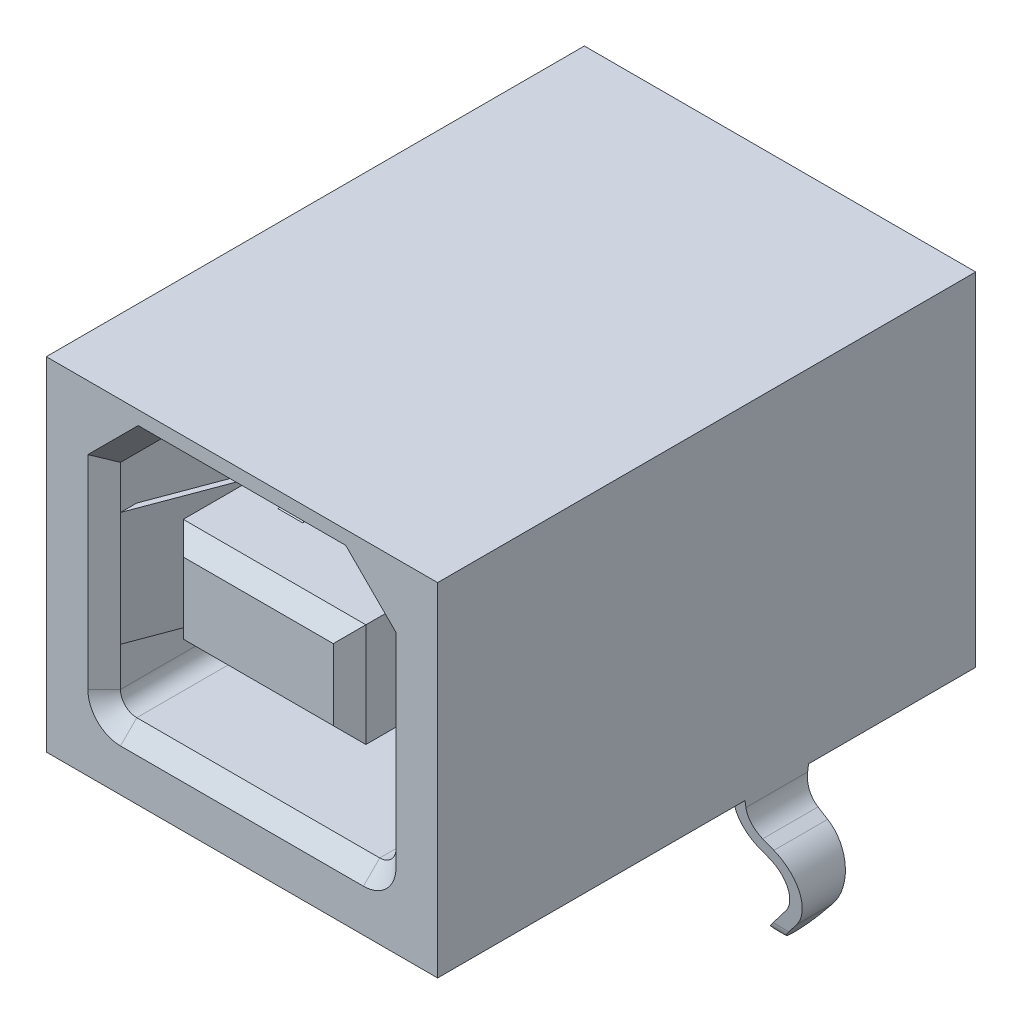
from build123d import *

# Parameters (mm, degrees)
SKETCH1_W                      = 12
SKETCH1_H                      = 10.5
BASE_DEPTH                     = 8.25
CONTACT_OPENING_DEPTH          = 9
CONTACT_OPENING_LEAD_IN_SIZE   = 0.5
SKETCH3_W                      = 5.6
SKETCH3_H                      = 3.18
CONTACT_AREA_DEPTH             = 8.5
CONTACT_AREA_LEAD_IN_SIZE      = 0.5
HOLDING_TINES_DEPTH            = 1.75
CONTACT_DEPTH                  = 0.375
CONTACT_PATTERN_COUNT          = 2
CONTACT_PATTERN_PITCH          = 2.5
TH_GROUND_LEGS_DEPTH           = 0.975
TH_GROUND_LEG_SHAPE_DEPTH      = 15.273342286
TH_GROUND_LEG_SHAPE_DEPTH_BACK = 15.273342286
TH_TAILS_DEPTH                 = 0.125
TH_TAILS_PATTERN_COUNT         = 2
TH_TAILS_PATTERN_PITCH         = 2


with BuildPart() as part:
    # Sketch1 → Base (new, symmetric)
    with BuildSketch(Plane.XY):
        Rectangle(SKETCH1_W, SKETCH1_H)
    extrude(amount=BASE_DEPTH, both=True)

    # Sketch2 → Contact Opening (cut)
    with BuildSketch(Plane.XY.offset(8.25)):
        with BuildLine():
            Line((-2.975, 4.33), (-4.225, 3.08))
            Line((-4.225, 3.08), (-4.225, -2.95))
            ThreePointArc((-4.225, -2.95), (-4.078553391, -3.303553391), (-3.725, -3.45))
            Line((-3.725, -3.45), (3.725, -3.45))
            ThreePointArc((3.725, -3.45), (4.078553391, -3.303553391), (4.225, -2.95))
            Line((4.225, -2.95), (4.225, 3.08))
            Line((4.225, 3.08), (2.975, 4.33))
            Line((2.975, 4.33), (-2.975, 4.33))
        make_face()
    extrude(amount=-CONTACT_OPENING_DEPTH, mode=Mode.SUBTRACT)

    # Contact Opening Lead-in
    contact_opening_lead_in_edges = [part.edges().sort_by_distance(p)[0] for p in [
        (0, 4.33, 8.25),
        (-3.6, 3.705, 8.25),
        (-4.225, 0.065, 8.25),
        (-4.078553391, -3.303553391, 8.25),
        (0, -3.45, 8.25),
        (4.078553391, -3.303553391, 8.25),
        (4.225, 0.065, 8.25),
        (3.6, 3.705, 8.25),
    ]]
    chamfer(contact_opening_lead_in_edges, length=CONTACT_OPENING_LEAD_IN_SIZE)

    # Sketch3 → Contact Area (add)
    with BuildSketch(Plane.XY.offset(-0.75)):
        with Locations((0, 0.44)):
            Rectangle(SKETCH3_W, SKETCH3_H)
    extrude(amount=CONTACT_AREA_DEPTH)

    # Contact Area Lead-in
    contact_area_lead_in_edges = [part.edges().sort_by_distance(p)[0] for p in [
        (-2.8, 0.44, 7.75),
        (0, -1.15, 7.75),
        (2.8, 0.44, 7.75),
        (0, 2.03, 7.75),
    ]]
    chamfer(contact_area_lead_in_edges, length=CONTACT_AREA_LEAD_IN_SIZE)

    # Sketch7 → Holding Tines (add, symmetric)
    with BuildSketch(Plane(origin=(0, 0, 0), x_dir=(1, 0, 0), z_dir=(0, 1, 0))):
        with BuildLine():
            Line((-4.225, -7.75), (-3.215243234, -5.051316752))
            ThreePointArc((-3.215243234, -5.051316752), (-3.027350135, -3.881276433), (-3.307189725, -2.729760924))
            Line((-3.307189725, -2.729760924), (-3.695, -1.9))
            Line((-3.695, -1.9), (-3.853538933, -1.974097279))
            Line((-3.853538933, -1.974097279), (-3.465728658, -2.803858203))
            ThreePointArc((-3.465728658, -2.803858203), (-3.202213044, -3.888201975), (-3.379145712, -4.989989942))
            Line((-3.379145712, -4.989989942), (-4.388902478, -7.688673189))
            Line((-4.388902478, -7.688673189), (-4.225, -7.75))
        make_face()
        with BuildLine():
            Line((4.225, -7.75), (4.388902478, -7.688673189))
            Line((4.388902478, -7.688673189), (3.379145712, -4.989989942))
            ThreePointArc((3.379145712, -4.989989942), (3.202213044, -3.888201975), (3.465728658, -2.803858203))
            Line((3.465728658, -2.803858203), (3.853538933, -1.974097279))
            Line((3.853538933, -1.974097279), (3.695, -1.9))
            Line((3.695, -1.9), (3.307189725, -2.729760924))
            ThreePointArc((3.307189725, -2.729760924), (3.027350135, -3.881276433), (3.215243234, -5.051316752))
            Line((3.215243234, -5.051316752), (4.225, -7.75))
        make_face()
    extrude(amount=HOLDING_TINES_DEPTH, both=True)

    # Sketch8 → Contact (add, symmetric)
    with BuildSketch(Plane(origin=(-1.25, 0, 0), x_dir=(0, 0, -1), z_dir=(1, 0, 0))):
        with BuildLine():
            Line((0.75, 2.03), (-2.695251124, 2.678262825))
            ThreePointArc((-2.695251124, 2.678262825), (-3.57053143, 2.712827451), (-4.418484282, 2.493086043))
            Line((-4.418484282, 2.493086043), (-5.75, 1.93))
            Line((-5.75, 1.93), (-5.681838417, 1.768819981))
            Line((-5.681838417, 1.768819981), (-4.350322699, 2.331906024))
            ThreePointArc((-4.350322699, 2.331906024), (-3.551833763, 2.538829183), (-2.727611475, 2.506280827))
            Line((-2.727611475, 2.506280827), (0.717639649, 1.858018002))
            Line((0.717639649, 1.858018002), (0.75, 2.03))
        make_face()
        with BuildLine():
            Line((-5.681838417, -0.888819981), (-5.75, -1.05))
            Line((-5.75, -1.05), (-4.418484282, -1.613086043))
            ThreePointArc((-4.418484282, -1.613086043), (-3.57053143, -1.832827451), (-2.695251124, -1.798262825))
            Line((-2.695251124, -1.798262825), (0.75, -1.15))
            Line((0.75, -1.15), (0.717639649, -0.978018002))
            Line((0.717639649, -0.978018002), (-2.727611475, -1.626280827))
            ThreePointArc((-2.727611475, -1.626280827), (-3.551833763, -1.658829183), (-4.350322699, -1.451906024))
            Line((-4.350322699, -1.451906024), (-5.681838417, -0.888819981))
        make_face()
    contact = extrude(amount=CONTACT_DEPTH, both=True)

    # Contact Pattern: Contact ×2
    with Locations(*[(i * CONTACT_PATTERN_PITCH, 0, 0) for i in range(1, CONTACT_PATTERN_COUNT)]):
        add(contact)

    # Sketch13 → TH Ground Legs (add, symmetric)
    with BuildSketch(Plane.XY.offset(-2.15)):
        with BuildLine():
            Line((6, -5.25), (6, -5.45))
            ThreePointArc((6, -5.45), (6.112536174, -5.84514538), (6.41637299, -6.121709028))
            Line((6.41637299, -6.121709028), (6.736045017, -6.280484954))
            ThreePointArc((6.736045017, -6.280484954), (7.400291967, -7.129098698), (7.157524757, -8.179066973))
            Line((7.157524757, -8.179066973), (6.527167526, -8.97))
            Line((6.527167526, -8.97), (6.23, -8.73316364))
            Line((6.23, -8.73316364), (6.860357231, -7.942230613))
            ThreePointArc((6.860357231, -7.942230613), (7.029323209, -7.211452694), (6.567007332, -6.620817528))
            Line((6.567007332, -6.620817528), (6.247335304, -6.462041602))
            ThreePointArc((6.247335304, -6.462041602), (5.789554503, -6.045352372), (5.62, -5.45))
            Line((5.62, -5.45), (5.62, -5.25))
            Line((5.62, -5.25), (6, -5.25))
        make_face()
        with BuildLine():
            Line((-5.62, -5.25), (-6, -5.25))
            Line((-6, -5.25), (-6, -5.45))
            ThreePointArc((-6, -5.45), (-6.112536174, -5.84514538), (-6.41637299, -6.121709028))
            Line((-6.41637299, -6.121709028), (-6.736045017, -6.280484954))
            ThreePointArc((-6.736045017, -6.280484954), (-7.400291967, -7.129098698), (-7.157524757, -8.179066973))
            Line((-7.157524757, -8.179066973), (-6.527167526, -8.97))
            Line((-6.527167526, -8.97), (-6.23, -8.73316364))
            Line((-6.23, -8.73316364), (-6.860357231, -7.942230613))
            ThreePointArc((-6.860357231, -7.942230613), (-7.029323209, -7.211452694), (-6.567007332, -6.620817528))
            Line((-6.567007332, -6.620817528), (-6.247335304, -6.462041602))
            ThreePointArc((-6.247335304, -6.462041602), (-5.789554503, -6.045352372), (-5.62, -5.45))
            Line((-5.62, -5.45), (-5.62, -5.25))
        make_face()
    extrude(amount=TH_GROUND_LEGS_DEPTH, both=True)

    # Sketch14 → TH Ground Leg Shape (cut, two sides: drawn at the far end of the back side and taken through both)
    with BuildSketch(Plane(origin=(0, 0, 0), x_dir=(0, 0, -1), z_dir=(1, 0, 0)).offset(-TH_GROUND_LEG_SHAPE_DEPTH_BACK)):
        with BuildLine():
            Line((3.125, -5.25), (3.125, -9))
            Line((3.125, -9), (1.175, -9))
            Line((1.175, -9), (1.175, -5.25))
            Line((1.175, -5.25), (1.655236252, -8.542172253))
            ThreePointArc((1.655236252, -8.542172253), (2.15, -8.97), (2.644763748, -8.542172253))
            Line((2.644763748, -8.542172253), (3.125, -5.25))
        make_face()
    extrude(amount=TH_GROUND_LEG_SHAPE_DEPTH + TH_GROUND_LEG_SHAPE_DEPTH_BACK, mode=Mode.SUBTRACT)

    # Sketch15 → TH Tails (add, symmetric)
    with BuildSketch(Plane(origin=(0, 0, -7.4), x_dir=(-1, 0, 0), z_dir=(0, 0, -1))):
        Polygon((-1.58, -5.25), (-0.92, -5.25), (-0.92, -8.1), (-1.041207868, -8.4), (-1.458792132, -8.4), (-1.58, -8.1), align=None)
        Polygon((0.92, -8.1), (1.041207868, -8.4), (1.458792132, -8.4), (1.58, -8.1), (1.58, -5.25), (0.92, -5.25), align=None)
    th_tails = extrude(amount=TH_TAILS_DEPTH, both=True)

    # TH Tails Pattern: TH Tails ×2
    with Locations(*[(0, 0, i * TH_TAILS_PATTERN_PITCH) for i in range(1, TH_TAILS_PATTERN_COUNT)]):
        add(th_tails)


solid = part.part
